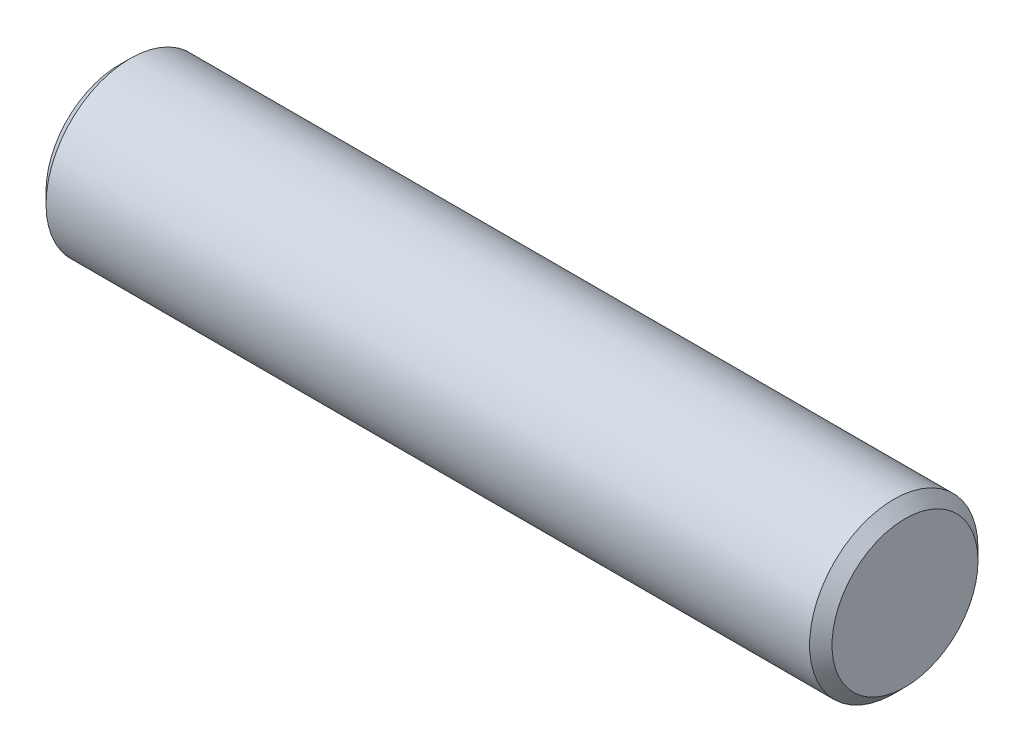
ISO-10303-21;
HEADER;
FILE_DESCRIPTION(('STEP AP214'),'2;1');
FILE_NAME('part.step','',(''),(''),'','','');
FILE_SCHEMA(('AUTOMOTIVE_DESIGN { 1 0 10303 214 1 1 1 1 }'));
ENDSEC;
DATA;
#1=APPLICATION_CONTEXT('core data for automotive mechanical design processes');
#2=APPLICATION_PROTOCOL_DEFINITION('international standard','automotive_design',2000,#1);
#3=PRODUCT_CONTEXT('',#1,'mechanical');
#4=PRODUCT('Part','Part','',(#3));
#5=PRODUCT_RELATED_PRODUCT_CATEGORY('part','',(#4));
#6=PRODUCT_DEFINITION_FORMATION('','',#4);
#7=PRODUCT_DEFINITION_CONTEXT('part definition',#1,'design');
#8=PRODUCT_DEFINITION('design','',#6,#7);
#9=PRODUCT_DEFINITION_SHAPE('','',#8);
#10=(LENGTH_UNIT() NAMED_UNIT(*) SI_UNIT(.MILLI.,.METRE.));
#11=(NAMED_UNIT(*) PLANE_ANGLE_UNIT() SI_UNIT($,.RADIAN.));
#12=(NAMED_UNIT(*) SI_UNIT($,.STERADIAN.) SOLID_ANGLE_UNIT());
#13=UNCERTAINTY_MEASURE_WITH_UNIT(LENGTH_MEASURE(1.E-05),#10,'distance_accuracy_value','');
#14=(GEOMETRIC_REPRESENTATION_CONTEXT(3) GLOBAL_UNCERTAINTY_ASSIGNED_CONTEXT((#13)) GLOBAL_UNIT_ASSIGNED_CONTEXT((#10,
#11,#12)) REPRESENTATION_CONTEXT('',''));
#15=CARTESIAN_POINT('',(0.,0.,0.));
#16=DIRECTION('',(0.,0.,1.));
#17=DIRECTION('',(1.,0.,0.));
#18=AXIS2_PLACEMENT_3D('',#15,#16,#17);
#19=CARTESIAN_POINT('',(0.,0.,0.));
#20=DIRECTION('',(1.,0.,0.));
#21=DIRECTION('',(0.,0.,-1.));
#22=AXIS2_PLACEMENT_3D('',#19,#20,#21);
#23=PLANE('',#22);
#24=CARTESIAN_POINT('',(0.,0.,0.));
#25=DIRECTION('',(1.,0.,0.));
#26=DIRECTION('',(0.,0.,-1.));
#27=AXIS2_PLACEMENT_3D('',#24,#25,#26);
#28=CIRCLE('',#27,6.49999999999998);
#29=CARTESIAN_POINT('',(0.,0.,-6.49999999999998));
#30=VERTEX_POINT('',#29);
#31=EDGE_CURVE('E36',#30,#30,#28,.T.);
#32=ORIENTED_EDGE('',*,*,#31,.T.);
#33=EDGE_LOOP('',(#32));
#34=FACE_BOUND('',#33,.T.);
#35=ADVANCED_FACE('F22',(#34),#23,.T.);
#36=CARTESIAN_POINT('',(40.,0.,0.));
#37=DIRECTION('',(1.,0.,0.));
#38=DIRECTION('',(0.,0.,-1.));
#39=AXIS2_PLACEMENT_3D('',#36,#37,#38);
#40=CYLINDRICAL_SURFACE('',#39,7.5);
#41=CARTESIAN_POINT('',(-1.00000000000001,0.,0.));
#42=DIRECTION('',(1.,0.,0.));
#43=DIRECTION('',(0.,0.,-1.));
#44=AXIS2_PLACEMENT_3D('',#41,#42,#43);
#45=CIRCLE('',#44,7.5);
#46=CARTESIAN_POINT('',(-1.00000000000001,0.,-7.5));
#47=VERTEX_POINT('',#46);
#48=EDGE_CURVE('E28',#47,#47,#45,.F.);
#49=ORIENTED_EDGE('',*,*,#48,.T.);
#50=EDGE_LOOP('',(#49));
#51=FACE_BOUND('',#50,.T.);
#52=CARTESIAN_POINT('',(-69.,0.,0.));
#53=DIRECTION('',(-1.,0.,0.));
#54=DIRECTION('',(0.,0.,1.));
#55=AXIS2_PLACEMENT_3D('',#52,#53,#54);
#56=CIRCLE('',#55,7.5);
#57=CARTESIAN_POINT('',(-69.,0.,7.5));
#58=VERTEX_POINT('',#57);
#59=EDGE_CURVE('E32',#58,#58,#56,.F.);
#60=ORIENTED_EDGE('',*,*,#59,.T.);
#61=EDGE_LOOP('',(#60));
#62=FACE_BOUND('',#61,.T.);
#63=ADVANCED_FACE('F55',(#51,#62),#40,.T.);
#64=CARTESIAN_POINT('',(-70.,0.,0.));
#65=DIRECTION('',(-1.,0.,0.));
#66=DIRECTION('',(0.,0.,1.));
#67=AXIS2_PLACEMENT_3D('',#64,#65,#66);
#68=PLANE('',#67);
#69=CARTESIAN_POINT('',(-70.,0.,0.));
#70=DIRECTION('',(-1.,0.,0.));
#71=DIRECTION('',(0.,0.,1.));
#72=AXIS2_PLACEMENT_3D('',#69,#70,#71);
#73=CIRCLE('',#72,6.49999999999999);
#74=CARTESIAN_POINT('',(-70.,0.,6.49999999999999));
#75=VERTEX_POINT('',#74);
#76=EDGE_CURVE('E10',#75,#75,#73,.T.);
#77=ORIENTED_EDGE('',*,*,#76,.T.);
#78=EDGE_LOOP('',(#77));
#79=FACE_BOUND('',#78,.T.);
#80=ADVANCED_FACE('F46',(#79),#68,.T.);
#81=CARTESIAN_POINT('',(0.,0.,0.));
#82=DIRECTION('',(-1.,0.,0.));
#83=DIRECTION('',(0.,0.,1.));
#84=AXIS2_PLACEMENT_3D('',#81,#82,#83);
#85=CONICAL_SURFACE('',#84,6.49999999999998,0.785398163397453);
#86=ORIENTED_EDGE('',*,*,#48,.F.);
#87=EDGE_LOOP('',(#86));
#88=FACE_BOUND('',#87,.T.);
#89=ORIENTED_EDGE('',*,*,#31,.F.);
#90=EDGE_LOOP('',(#89));
#91=FACE_BOUND('',#90,.T.);
#92=ADVANCED_FACE('F43',(#88,#91),#85,.T.);
#93=CARTESIAN_POINT('',(-69.,0.,0.));
#94=DIRECTION('',(1.,0.,0.));
#95=DIRECTION('',(0.,0.,-1.));
#96=AXIS2_PLACEMENT_3D('',#93,#94,#95);
#97=CONICAL_SURFACE('',#96,7.5,0.785398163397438);
#98=ORIENTED_EDGE('',*,*,#76,.F.);
#99=EDGE_LOOP('',(#98));
#100=FACE_BOUND('',#99,.T.);
#101=ORIENTED_EDGE('',*,*,#59,.F.);
#102=EDGE_LOOP('',(#101));
#103=FACE_BOUND('',#102,.T.);
#104=ADVANCED_FACE('F45',(#100,#103),#97,.T.);
#105=CLOSED_SHELL('',(#35,#63,#80,#92,#104));
#106=MANIFOLD_SOLID_BREP('B2',#105);
#107=ADVANCED_BREP_SHAPE_REPRESENTATION('',(#18,#106),#14);
#108=SHAPE_DEFINITION_REPRESENTATION(#9,#107);
ENDSEC;
END-ISO-10303-21;
